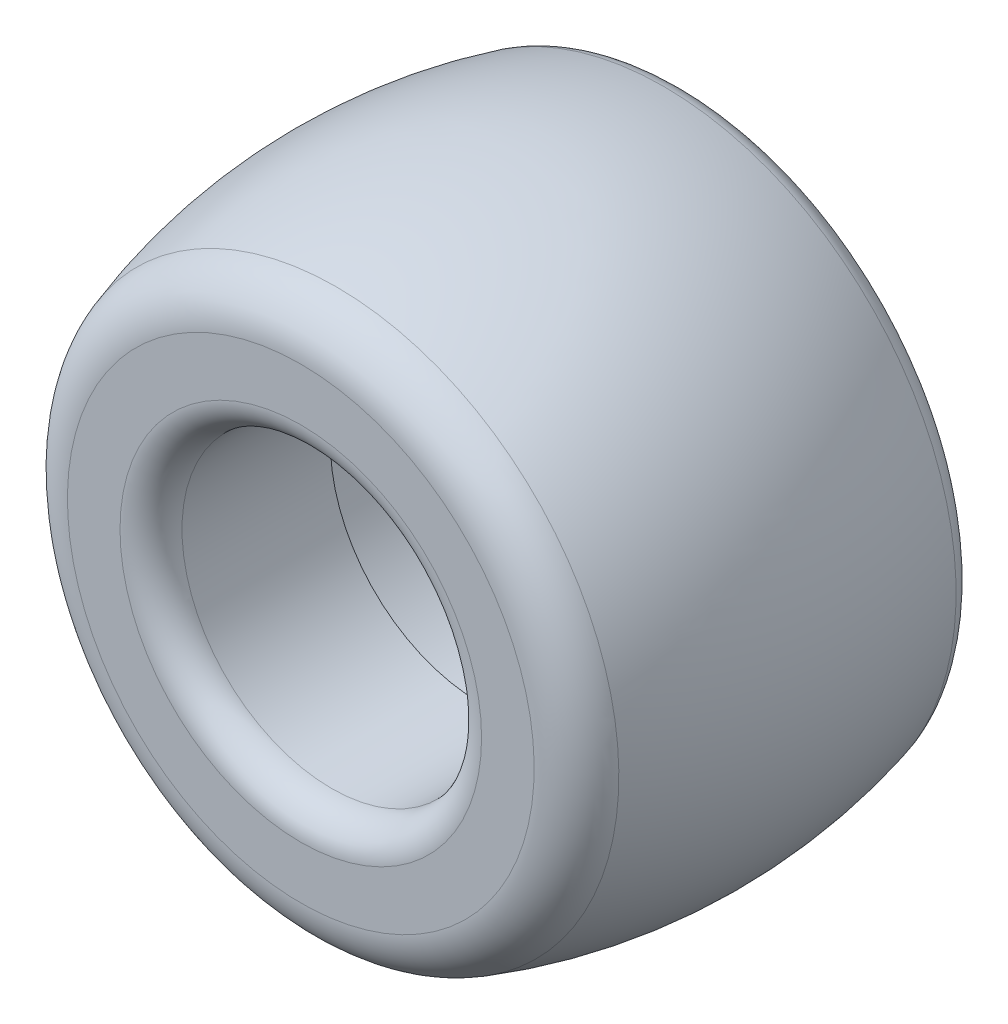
from build123d import *


with BuildPart() as part:
    # Esquisse1 → R_volution1 (revolve)
    with BuildSketch(Plane.XZ.offset(-509.395199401), mode=Mode.PRIVATE) as r_volution1_sk:
        with BuildLine():
            Line((-1701.795683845, -887.035640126), (-1698.795683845, -887.035640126))
            Line((-1698.795683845, -887.035640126), (-1698.795683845, -900.368716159))
            Line((-1698.795683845, -900.368716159), (-1693.007439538, -906.156960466))
            ThreePointArc((-1693.007439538, -906.156960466), (-1690.099630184, -906.930710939), (-1687.98303271, -904.792005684))
            ThreePointArc((-1687.98303271, -904.792005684), (-1686.191910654, -888.884416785), (-1688.953432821, -873.11630028))
            ThreePointArc((-1688.953432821, -873.11630028), (-1690.770719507, -870.622755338), (-1693.705670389, -869.67072561))
            Line((-1693.705670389, -869.67072561), (-1698.795683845, -869.67072561))
            ThreePointArc((-1698.795683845, -869.67072561), (-1700.917004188, -870.549405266), (-1701.795683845, -872.67072561))
            Line((-1701.795683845, -872.67072561), (-1701.795683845, -887.035640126))
        make_face()
    revolve(r_volution1_sk.sketch.rotate(Axis((-1716.295683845, 509.395199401, -869.67072561), (0, 0, -1)), 270), axis=Axis((-1716.295683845, 509.395199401, -869.67072561), (0, 0, -1)))


solid = part.part
